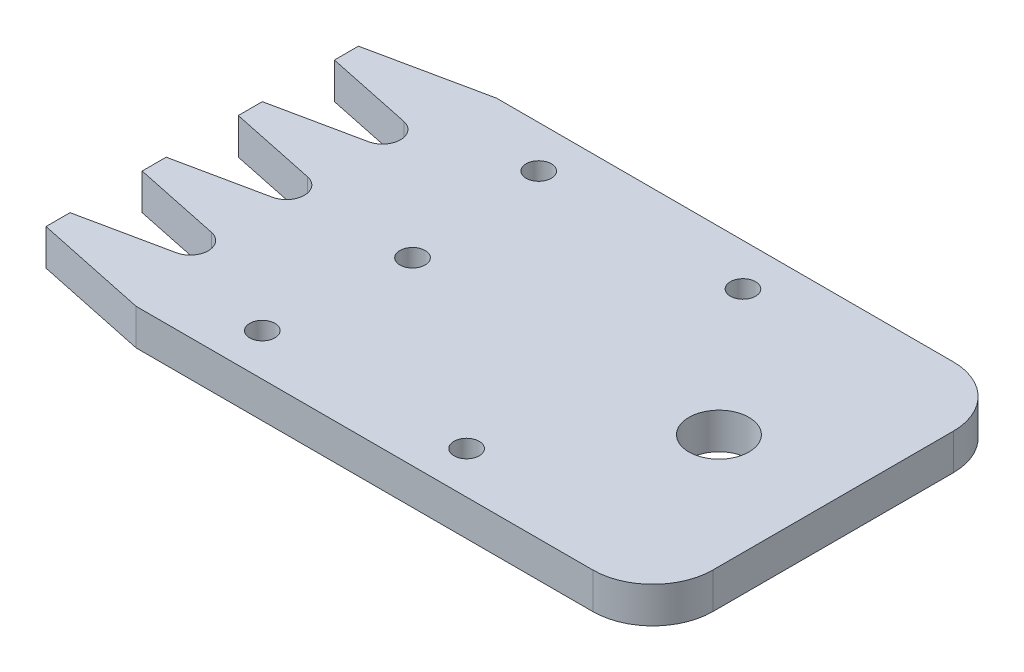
from build123d import *

# Parameters (mm, degrees)
SKETCH1_R         = 5
EXTRUDE1_DEPTH    = 6
M5_TAPPED_HOLE1_D = 4.2


with BuildPart() as part:
    # Sketch1 → Extrude1 (new body)
    with BuildSketch(Plane(origin=(0, 0, 0), x_dir=(1, 0, 0), z_dir=(0, 1, 0))):
        with BuildLine():
            Line((19, 0), (95, 0))
            ThreePointArc((95, 0), (102.071067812, 2.928932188), (105, 10))
            Line((105, 10), (105, 50))
            ThreePointArc((105, 50), (102.071067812, 57.071067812), (95, 60))
            Line((95, 60), (19, 60))
            Line((19, 60), (0, 56))
            Line((0, 56), (0, 52))
            Line((0, 52), (14.615505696, 48.936179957))
            ThreePointArc((14.615505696, 48.936179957), (17, 46), (14.615505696, 43.063820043))
            Line((14.615505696, 43.063820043), (0, 40))
            Line((0, 40), (0, 36))
            Line((0, 36), (14.615505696, 32.936179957))
            ThreePointArc((14.615505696, 32.936179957), (17, 30), (14.615505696, 27.063820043))
            Line((14.615505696, 27.063820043), (0, 24))
            Line((0, 24), (0, 20))
            Line((0, 20), (14.615505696, 16.936179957))
            ThreePointArc((14.615505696, 16.936179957), (17, 14), (14.615505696, 11.063820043))
            Line((14.615505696, 11.063820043), (0, 8))
            Line((0, 8), (0, 4))
            Line((0, 4), (19, 0))
        make_face()
        with Locations(Location((86, 30, 0), (0, 0, 270))):
            Circle(SKETCH1_R, mode=Mode.SUBTRACT)
    extrude(amount=EXTRUDE1_DEPTH)

    # M5 Tapped Hole1 (through all)
    with Locations(Plane(origin=(33, 6, -53), x_dir=(0, 0, 1), z_dir=(0, 1, 0))):
        with Locations((0, 0), (23, 2), (46, 0), (46, 34), (0, 34)):
            Hole(M5_TAPPED_HOLE1_D / 2)


solid = part.part
